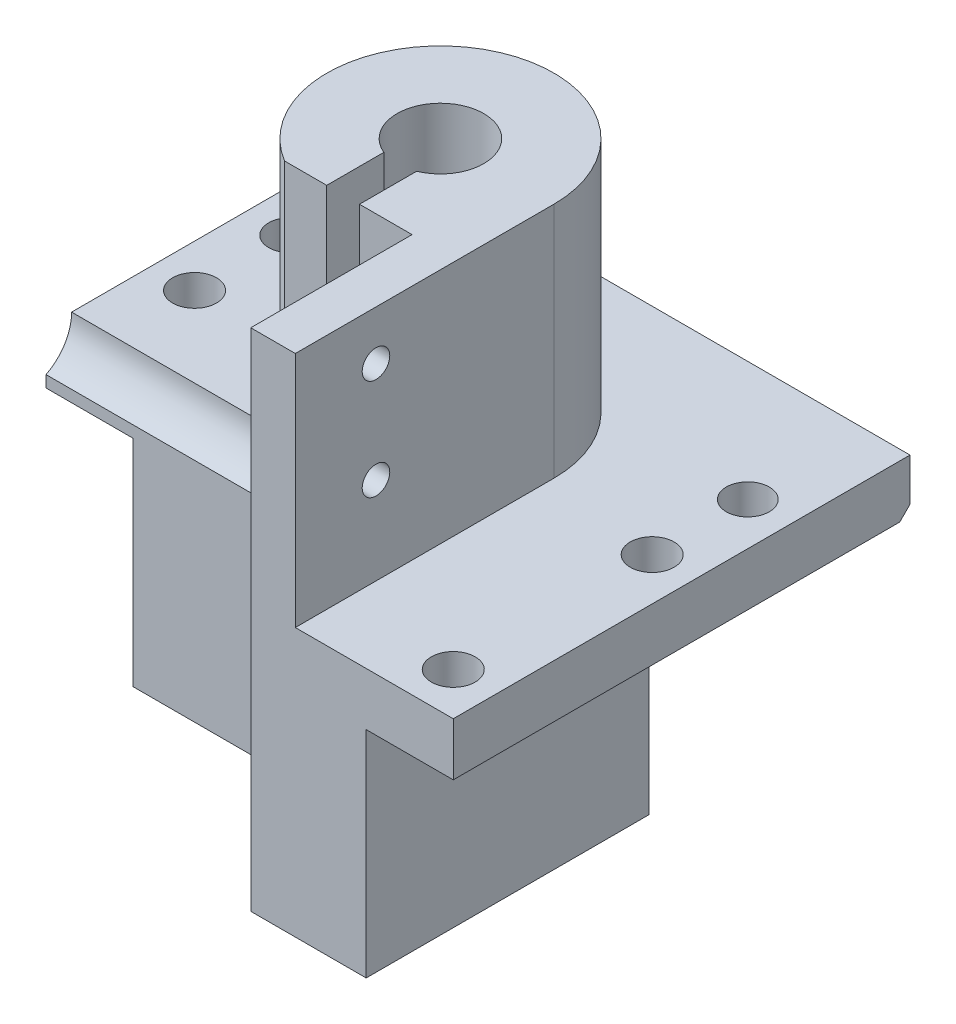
ISO-10303-21;
HEADER;
FILE_DESCRIPTION(('STEP AP214'),'2;1');
FILE_NAME('part.step','',(''),(''),'','','');
FILE_SCHEMA(('AUTOMOTIVE_DESIGN { 1 0 10303 214 1 1 1 1 }'));
ENDSEC;
DATA;
#1=APPLICATION_CONTEXT('core data for automotive mechanical design processes');
#2=APPLICATION_PROTOCOL_DEFINITION('international standard','automotive_design',2000,#1);
#3=PRODUCT_CONTEXT('',#1,'mechanical');
#4=PRODUCT('Part','Part','',(#3));
#5=PRODUCT_RELATED_PRODUCT_CATEGORY('part','',(#4));
#6=PRODUCT_DEFINITION_FORMATION('','',#4);
#7=PRODUCT_DEFINITION_CONTEXT('part definition',#1,'design');
#8=PRODUCT_DEFINITION('design','',#6,#7);
#9=PRODUCT_DEFINITION_SHAPE('','',#8);
#10=(LENGTH_UNIT() NAMED_UNIT(*) SI_UNIT(.MILLI.,.METRE.));
#11=(NAMED_UNIT(*) PLANE_ANGLE_UNIT() SI_UNIT($,.RADIAN.));
#12=(NAMED_UNIT(*) SI_UNIT($,.STERADIAN.) SOLID_ANGLE_UNIT());
#13=UNCERTAINTY_MEASURE_WITH_UNIT(LENGTH_MEASURE(1.E-05),#10,'distance_accuracy_value','');
#14=(GEOMETRIC_REPRESENTATION_CONTEXT(3) GLOBAL_UNCERTAINTY_ASSIGNED_CONTEXT((#13)) GLOBAL_UNIT_ASSIGNED_CONTEXT((#10,
#11,#12)) REPRESENTATION_CONTEXT('',''));
#15=CARTESIAN_POINT('',(0.,0.,0.));
#16=DIRECTION('',(0.,0.,1.));
#17=DIRECTION('',(1.,0.,0.));
#18=AXIS2_PLACEMENT_3D('',#15,#16,#17);
#19=CARTESIAN_POINT('',(0.,-16.002,0.));
#20=DIRECTION('',(0.,1.,0.));
#21=DIRECTION('',(0.,0.,1.));
#22=AXIS2_PLACEMENT_3D('',#19,#20,#21);
#23=CYLINDRICAL_SURFACE('',#22,15.7988);
#24=DIRECTION('',(0.,1.,0.));
#25=VECTOR('',#24,1.);
#26=CARTESIAN_POINT('',(-13.2513807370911,-16.002,8.60249905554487));
#27=LINE('',#26,#25);
#28=CARTESIAN_POINT('',(-13.2513807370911,0.,8.60249905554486));
#29=VERTEX_POINT('',#28);
#30=CARTESIAN_POINT('',(-13.2513807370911,-16.002,8.60249905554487));
#31=VERTEX_POINT('',#30);
#32=EDGE_CURVE('E58',#29,#31,#27,.F.);
#33=ORIENTED_EDGE('',*,*,#32,.F.);
#34=CARTESIAN_POINT('',(0.,0.,0.));
#35=DIRECTION('',(0.,1.,0.));
#36=DIRECTION('',(0.,0.,-1.));
#37=AXIS2_PLACEMENT_3D('',#34,#35,#36);
#38=CIRCLE('',#37,15.7988);
#39=CARTESIAN_POINT('',(13.2513807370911,0.,8.60249905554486));
#40=VERTEX_POINT('',#39);
#41=EDGE_CURVE('E222',#29,#40,#38,.T.);
#42=ORIENTED_EDGE('',*,*,#41,.T.);
#43=DIRECTION('',(0.,1.,0.));
#44=VECTOR('',#43,1.);
#45=CARTESIAN_POINT('',(13.2513807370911,-16.002,8.60249905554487));
#46=LINE('',#45,#44);
#47=CARTESIAN_POINT('',(13.2513807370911,-16.002,8.60249905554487));
#48=VERTEX_POINT('',#47);
#49=EDGE_CURVE('E193',#48,#40,#46,.T.);
#50=ORIENTED_EDGE('',*,*,#49,.F.);
#51=CARTESIAN_POINT('',(0.,-16.002,0.));
#52=DIRECTION('',(0.,1.,0.));
#53=DIRECTION('',(0.,0.,-1.));
#54=AXIS2_PLACEMENT_3D('',#51,#52,#53);
#55=CIRCLE('',#54,15.7988);
#56=EDGE_CURVE('E216',#31,#48,#55,.T.);
#57=ORIENTED_EDGE('',*,*,#56,.F.);
#58=EDGE_LOOP('',(#33,#42,#50,#57));
#59=FACE_BOUND('',#58,.T.);
#60=ADVANCED_FACE('F33',(#59),#23,.F.);
#61=CARTESIAN_POINT('',(13.716,-16.002,7.84049905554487));
#62=DIRECTION('',(-1.,0.,0.));
#63=DIRECTION('',(0.,0.,1.));
#64=AXIS2_PLACEMENT_3D('',#61,#62,#63);
#65=PLANE('',#64);
#66=DIRECTION('',(0.,-1.,0.));
#67=VECTOR('',#66,1.);
#68=CARTESIAN_POINT('',(13.716,-16.002,8.60249905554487));
#69=LINE('',#68,#67);
#70=CARTESIAN_POINT('',(13.716,0.,8.60249905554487));
#71=VERTEX_POINT('',#70);
#72=CARTESIAN_POINT('',(13.716,-16.002,8.60249905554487));
#73=VERTEX_POINT('',#72);
#74=EDGE_CURVE('E50',#71,#73,#69,.T.);
#75=ORIENTED_EDGE('',*,*,#74,.F.);
#76=DIRECTION('',(0.,0.,1.));
#77=VECTOR('',#76,1.);
#78=CARTESIAN_POINT('',(13.716,0.,7.84049905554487));
#79=LINE('',#78,#77);
#80=CARTESIAN_POINT('',(13.716,0.,29.653));
#81=VERTEX_POINT('',#80);
#82=EDGE_CURVE('E205',#71,#81,#79,.T.);
#83=ORIENTED_EDGE('',*,*,#82,.T.);
#84=DIRECTION('',(0.,-1.,0.));
#85=VECTOR('',#84,1.);
#86=CARTESIAN_POINT('',(13.716,-16.002,29.653));
#87=LINE('',#86,#85);
#88=CARTESIAN_POINT('',(13.716,-16.002,29.653));
#89=VERTEX_POINT('',#88);
#90=EDGE_CURVE('E484',#81,#89,#87,.T.);
#91=ORIENTED_EDGE('',*,*,#90,.T.);
#92=DIRECTION('',(0.,0.,1.));
#93=VECTOR('',#92,1.);
#94=CARTESIAN_POINT('',(13.716,-16.002,7.84049905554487));
#95=LINE('',#94,#93);
#96=EDGE_CURVE('E207',#73,#89,#95,.T.);
#97=ORIENTED_EDGE('',*,*,#96,.F.);
#98=EDGE_LOOP('',(#75,#83,#91,#97));
#99=FACE_BOUND('',#98,.T.);
#100=ADVANCED_FACE('F203',(#99),#65,.F.);
#101=CARTESIAN_POINT('',(-13.716,-16.002,25.4));
#102=DIRECTION('',(1.,0.,0.));
#103=DIRECTION('',(0.,0.,-1.));
#104=AXIS2_PLACEMENT_3D('',#101,#102,#103);
#105=PLANE('',#104);
#106=DIRECTION('',(0.,1.,0.));
#107=VECTOR('',#106,1.);
#108=CARTESIAN_POINT('',(-13.716,-16.002,8.60249905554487));
#109=LINE('',#108,#107);
#110=CARTESIAN_POINT('',(-13.716,-16.002,8.60249905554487));
#111=VERTEX_POINT('',#110);
#112=CARTESIAN_POINT('',(-13.716,0.,8.60249905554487));
#113=VERTEX_POINT('',#112);
#114=EDGE_CURVE('E198',#111,#113,#109,.T.);
#115=ORIENTED_EDGE('',*,*,#114,.F.);
#116=DIRECTION('',(0.,0.,-1.));
#117=VECTOR('',#116,1.);
#118=CARTESIAN_POINT('',(-13.716,-16.002,25.4));
#119=LINE('',#118,#117);
#120=CARTESIAN_POINT('',(-13.716,-16.002,19.558));
#121=VERTEX_POINT('',#120);
#122=EDGE_CURVE('E227',#121,#111,#119,.T.);
#123=ORIENTED_EDGE('',*,*,#122,.F.);
#124=DIRECTION('',(0.,1.,0.));
#125=VECTOR('',#124,1.);
#126=CARTESIAN_POINT('',(-13.716,-16.002,19.558));
#127=LINE('',#126,#125);
#128=CARTESIAN_POINT('',(-13.716,0.,19.558));
#129=VERTEX_POINT('',#128);
#130=EDGE_CURVE('E532',#121,#129,#127,.T.);
#131=ORIENTED_EDGE('',*,*,#130,.T.);
#132=DIRECTION('',(0.,0.,-1.));
#133=VECTOR('',#132,1.);
#134=CARTESIAN_POINT('',(-13.716,0.,25.4));
#135=LINE('',#134,#133);
#136=EDGE_CURVE('E212',#129,#113,#135,.T.);
#137=ORIENTED_EDGE('',*,*,#136,.T.);
#138=EDGE_LOOP('',(#115,#123,#131,#137));
#139=FACE_BOUND('',#138,.T.);
#140=ADVANCED_FACE('F373',(#139),#105,.F.);
#141=CARTESIAN_POINT('',(0.,-16.002,0.));
#142=DIRECTION('',(0.,-1.,0.));
#143=DIRECTION('',(0.,0.,-1.));
#144=AXIS2_PLACEMENT_3D('',#141,#142,#143);
#145=PLANE('',#144);
#146=CARTESIAN_POINT('',(9.271,-16.002,25.462));
#147=DIRECTION('',(0.,-1.,0.));
#148=DIRECTION('',(0.,0.,-1.));
#149=AXIS2_PLACEMENT_3D('',#146,#147,#148);
#150=CIRCLE('',#149,1.58369);
#151=CARTESIAN_POINT('',(9.271,-16.002,23.87831));
#152=VERTEX_POINT('',#151);
#153=EDGE_CURVE('E429',#152,#152,#150,.T.);
#154=ORIENTED_EDGE('',*,*,#153,.F.);
#155=EDGE_LOOP('',(#154));
#156=FACE_BOUND('',#155,.T.);
#157=CARTESIAN_POINT('',(-10.287,-16.002,16.637));
#158=DIRECTION('',(0.,-1.,0.));
#159=DIRECTION('',(0.,0.,-1.));
#160=AXIS2_PLACEMENT_3D('',#157,#158,#159);
#161=CIRCLE('',#160,1.1303);
#162=CARTESIAN_POINT('',(-10.287,-16.002,15.5067));
#163=VERTEX_POINT('',#162);
#164=EDGE_CURVE('E435',#163,#163,#161,.T.);
#165=ORIENTED_EDGE('',*,*,#164,.F.);
#166=EDGE_LOOP('',(#165));
#167=FACE_BOUND('',#166,.T.);
#168=CARTESIAN_POINT('',(9.271,-16.002,16.637));
#169=DIRECTION('',(0.,-1.,0.));
#170=DIRECTION('',(0.,0.,-1.));
#171=AXIS2_PLACEMENT_3D('',#168,#169,#170);
#172=CIRCLE('',#171,1.1303);
#173=CARTESIAN_POINT('',(9.271,-16.002,15.5067));
#174=VERTEX_POINT('',#173);
#175=EDGE_CURVE('E441',#174,#174,#172,.T.);
#176=ORIENTED_EDGE('',*,*,#175,.F.);
#177=EDGE_LOOP('',(#176));
#178=FACE_BOUND('',#177,.T.);
#179=ORIENTED_EDGE('',*,*,#122,.T.);
#180=DIRECTION('',(1.,0.,0.));
#181=VECTOR('',#180,1.);
#182=CARTESIAN_POINT('',(0.,-16.002,8.60249905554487));
#183=LINE('',#182,#181);
#184=EDGE_CURVE('E12',#111,#31,#183,.T.);
#185=ORIENTED_EDGE('',*,*,#184,.T.);
#186=ORIENTED_EDGE('',*,*,#56,.T.);
#187=EDGE_CURVE('E42',#48,#73,#183,.T.);
#188=ORIENTED_EDGE('',*,*,#187,.T.);
#189=ORIENTED_EDGE('',*,*,#96,.T.);
#190=DIRECTION('',(-1.,0.,0.));
#191=VECTOR('',#190,1.);
#192=CARTESIAN_POINT('',(5.13080000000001,-16.002,29.653));
#193=LINE('',#192,#191);
#194=CARTESIAN_POINT('',(5.1308,-16.002,29.653));
#195=VERTEX_POINT('',#194);
#196=EDGE_CURVE('E486',#89,#195,#193,.T.);
#197=ORIENTED_EDGE('',*,*,#196,.T.);
#198=DIRECTION('',(0.,0.,-1.));
#199=VECTOR('',#198,1.);
#200=CARTESIAN_POINT('',(5.1308,-16.002,25.4));
#201=LINE('',#200,#199);
#202=CARTESIAN_POINT('',(5.1308,-16.002,19.558));
#203=VERTEX_POINT('',#202);
#204=EDGE_CURVE('E518',#195,#203,#201,.T.);
#205=ORIENTED_EDGE('',*,*,#204,.T.);
#206=DIRECTION('',(1.,0.,0.));
#207=VECTOR('',#206,1.);
#208=CARTESIAN_POINT('',(-20.193,-16.002,19.558));
#209=LINE('',#208,#207);
#210=EDGE_CURVE('E529',#121,#203,#209,.T.);
#211=ORIENTED_EDGE('',*,*,#210,.F.);
#212=EDGE_LOOP('',(#179,#185,#186,#188,#189,#197,#205,#211));
#213=FACE_BOUND('',#212,.T.);
#214=ADVANCED_FACE('F581',(#156,#167,#178,#213),#145,.T.);
#215=CARTESIAN_POINT('',(8.4455,21.59,25.4));
#216=DIRECTION('',(-1.,0.,0.));
#217=DIRECTION('',(0.,-1.,0.));
#218=AXIS2_PLACEMENT_3D('',#215,#216,#217);
#219=PLANE('',#218);
#220=CARTESIAN_POINT('',(8.4455,17.937,23.653));
#221=DIRECTION('',(1.,0.,0.));
#222=DIRECTION('',(0.,0.,-1.));
#223=AXIS2_PLACEMENT_3D('',#220,#221,#222);
#224=CIRCLE('',#223,1.02499999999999);
#225=CARTESIAN_POINT('',(8.4455,17.937,22.628));
#226=VERTEX_POINT('',#225);
#227=EDGE_CURVE('E448',#226,#226,#224,.T.);
#228=ORIENTED_EDGE('',*,*,#227,.F.);
#229=EDGE_LOOP('',(#228));
#230=FACE_BOUND('',#229,.T.);
#231=CARTESIAN_POINT('',(8.4455,10.437,23.653));
#232=DIRECTION('',(1.,0.,0.));
#233=DIRECTION('',(0.,0.,-1.));
#234=AXIS2_PLACEMENT_3D('',#231,#232,#233);
#235=CIRCLE('',#234,1.025);
#236=CARTESIAN_POINT('',(8.4455,10.437,22.628));
#237=VERTEX_POINT('',#236);
#238=EDGE_CURVE('E452',#237,#237,#235,.T.);
#239=ORIENTED_EDGE('',*,*,#238,.F.);
#240=EDGE_LOOP('',(#239));
#241=FACE_BOUND('',#240,.T.);
#242=DIRECTION('',(0.,1.,0.));
#243=VECTOR('',#242,1.);
#244=CARTESIAN_POINT('',(8.4455,-27.2155864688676,10.414));
#245=LINE('',#244,#243);
#246=CARTESIAN_POINT('',(8.4455,3.937,10.414));
#247=VERTEX_POINT('',#246);
#248=CARTESIAN_POINT('',(8.4455,21.59,10.414));
#249=VERTEX_POINT('',#248);
#250=EDGE_CURVE('E460',#247,#249,#245,.T.);
#251=ORIENTED_EDGE('',*,*,#250,.T.);
#252=DIRECTION('',(0.,0.,-1.));
#253=VECTOR('',#252,1.);
#254=CARTESIAN_POINT('',(8.4455,21.59,25.4));
#255=LINE('',#254,#253);
#256=CARTESIAN_POINT('',(8.4455,21.59,29.653));
#257=VERTEX_POINT('',#256);
#258=EDGE_CURVE('E242',#257,#249,#255,.T.);
#259=ORIENTED_EDGE('',*,*,#258,.F.);
#260=DIRECTION('',(0.,-1.,0.));
#261=VECTOR('',#260,1.);
#262=CARTESIAN_POINT('',(8.4455,3.937,29.653));
#263=LINE('',#262,#261);
#264=CARTESIAN_POINT('',(8.4455,3.937,29.653));
#265=VERTEX_POINT('',#264);
#266=EDGE_CURVE('E474',#257,#265,#263,.T.);
#267=ORIENTED_EDGE('',*,*,#266,.T.);
#268=DIRECTION('',(0.,0.,1.));
#269=VECTOR('',#268,1.);
#270=CARTESIAN_POINT('',(8.4455,3.937,25.4));
#271=LINE('',#270,#269);
#272=EDGE_CURVE('E219',#247,#265,#271,.T.);
#273=ORIENTED_EDGE('',*,*,#272,.F.);
#274=EDGE_LOOP('',(#251,#259,#267,#273));
#275=FACE_BOUND('',#274,.T.);
#276=ADVANCED_FACE('F569',(#230,#241,#275),#219,.F.);
#277=CARTESIAN_POINT('',(8.4455,3.937,25.4));
#278=DIRECTION('',(0.,-1.,0.));
#279=DIRECTION('',(0.,0.,-1.));
#280=AXIS2_PLACEMENT_3D('',#277,#278,#279);
#281=PLANE('',#280);
#282=CARTESIAN_POINT('',(17.018,3.937,4.572));
#283=DIRECTION('',(0.,1.,0.));
#284=DIRECTION('',(0.,0.,1.));
#285=AXIS2_PLACEMENT_3D('',#282,#283,#284);
#286=CIRCLE('',#285,1.6002);
#287=CARTESIAN_POINT('',(17.018,3.937,6.1722));
#288=VERTEX_POINT('',#287);
#289=EDGE_CURVE('E619',#288,#288,#286,.T.);
#290=ORIENTED_EDGE('',*,*,#289,.F.);
#291=EDGE_LOOP('',(#290));
#292=FACE_BOUND('',#291,.T.);
#293=CARTESIAN_POINT('',(-17.018,3.937,4.572));
#294=DIRECTION('',(0.,1.,0.));
#295=DIRECTION('',(0.,0.,1.));
#296=AXIS2_PLACEMENT_3D('',#293,#294,#295);
#297=CIRCLE('',#296,1.6002);
#298=CARTESIAN_POINT('',(-17.018,3.937,6.1722));
#299=VERTEX_POINT('',#298);
#300=EDGE_CURVE('E613',#299,#299,#297,.T.);
#301=ORIENTED_EDGE('',*,*,#300,.F.);
#302=EDGE_LOOP('',(#301));
#303=FACE_BOUND('',#302,.T.);
#304=CARTESIAN_POINT('',(-17.018,3.937,11.684));
#305=DIRECTION('',(0.,-1.,0.));
#306=DIRECTION('',(0.,0.,-1.));
#307=AXIS2_PLACEMENT_3D('',#304,#305,#306);
#308=CIRCLE('',#307,1.63194999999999);
#309=CARTESIAN_POINT('',(-17.018,3.937,10.05205));
#310=VERTEX_POINT('',#309);
#311=EDGE_CURVE('E614',#310,#310,#308,.T.);
#312=ORIENTED_EDGE('',*,*,#311,.T.);
#313=EDGE_LOOP('',(#312));
#314=FACE_BOUND('',#313,.T.);
#315=CARTESIAN_POINT('',(17.018,3.937,11.684));
#316=DIRECTION('',(0.,-1.,0.));
#317=DIRECTION('',(0.,0.,-1.));
#318=AXIS2_PLACEMENT_3D('',#315,#316,#317);
#319=CIRCLE('',#318,1.63194999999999);
#320=CARTESIAN_POINT('',(17.018,3.937,10.05205));
#321=VERTEX_POINT('',#320);
#322=EDGE_CURVE('E418',#321,#321,#319,.T.);
#323=ORIENTED_EDGE('',*,*,#322,.T.);
#324=EDGE_LOOP('',(#323));
#325=FACE_BOUND('',#324,.T.);
#326=CARTESIAN_POINT('',(17.018,3.937,26.478));
#327=DIRECTION('',(0.,-1.,0.));
#328=DIRECTION('',(0.,0.,-1.));
#329=AXIS2_PLACEMENT_3D('',#326,#327,#328);
#330=CIRCLE('',#329,1.63194999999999);
#331=CARTESIAN_POINT('',(17.018,3.937,24.84605));
#332=VERTEX_POINT('',#331);
#333=EDGE_CURVE('E417',#332,#332,#330,.T.);
#334=ORIENTED_EDGE('',*,*,#333,.T.);
#335=EDGE_LOOP('',(#334));
#336=FACE_BOUND('',#335,.T.);
#337=DIRECTION('',(0.,0.,-1.));
#338=VECTOR('',#337,1.);
#339=CARTESIAN_POINT('',(-20.193,3.937,-4.318));
#340=LINE('',#339,#338);
#341=CARTESIAN_POINT('',(-20.193,3.937,17.653));
#342=VERTEX_POINT('',#341);
#343=CARTESIAN_POINT('',(-20.193,3.937,-4.318));
#344=VERTEX_POINT('',#343);
#345=EDGE_CURVE('E545',#342,#344,#340,.T.);
#346=ORIENTED_EDGE('',*,*,#345,.F.);
#347=DIRECTION('',(1.,0.,0.));
#348=VECTOR('',#347,1.);
#349=CARTESIAN_POINT('',(-20.193,3.937,17.653));
#350=LINE('',#349,#348);
#351=CARTESIAN_POINT('',(-4.35009761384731,3.937,17.653));
#352=VERTEX_POINT('',#351);
#353=EDGE_CURVE('E534',#342,#352,#350,.T.);
#354=ORIENTED_EDGE('',*,*,#353,.T.);
#355=CARTESIAN_POINT('',(0.,3.937,10.414));
#356=DIRECTION('',(0.,-1.,0.));
#357=DIRECTION('',(0.,0.,-1.));
#358=AXIS2_PLACEMENT_3D('',#355,#356,#357);
#359=CIRCLE('',#358,8.4455);
#360=EDGE_CURVE('E458',#352,#247,#359,.T.);
#361=ORIENTED_EDGE('',*,*,#360,.T.);
#362=ORIENTED_EDGE('',*,*,#272,.T.);
#363=DIRECTION('',(1.,0.,0.));
#364=VECTOR('',#363,1.);
#365=CARTESIAN_POINT('',(20.193,3.937,29.653));
#366=LINE('',#365,#364);
#367=CARTESIAN_POINT('',(20.193,3.937,29.653));
#368=VERTEX_POINT('',#367);
#369=EDGE_CURVE('E477',#265,#368,#366,.T.);
#370=ORIENTED_EDGE('',*,*,#369,.T.);
#371=DIRECTION('',(0.,0.,-1.));
#372=VECTOR('',#371,1.);
#373=CARTESIAN_POINT('',(20.193,3.937,-4.318));
#374=LINE('',#373,#372);
#375=CARTESIAN_POINT('',(20.193,3.937,-4.318));
#376=VERTEX_POINT('',#375);
#377=EDGE_CURVE('E552',#368,#376,#374,.T.);
#378=ORIENTED_EDGE('',*,*,#377,.T.);
#379=DIRECTION('',(-1.,0.,0.));
#380=VECTOR('',#379,1.);
#381=CARTESIAN_POINT('',(20.193,3.937,-4.318));
#382=LINE('',#381,#380);
#383=EDGE_CURVE('E554',#376,#344,#382,.T.);
#384=ORIENTED_EDGE('',*,*,#383,.T.);
#385=EDGE_LOOP('',(#346,#354,#361,#362,#370,#378,#384));
#386=FACE_BOUND('',#385,.T.);
#387=ADVANCED_FACE('F561',(#292,#303,#314,#325,#336,#386),#281,.F.);
#388=CARTESIAN_POINT('',(-20.193,3.937,-4.318));
#389=DIRECTION('',(-1.,0.,0.));
#390=DIRECTION('',(0.,0.,1.));
#391=AXIS2_PLACEMENT_3D('',#388,#389,#390);
#392=PLANE('',#391);
#393=DIRECTION('',(0.,-1.,0.));
#394=VECTOR('',#393,1.);
#395=CARTESIAN_POINT('',(-20.193,3.937,-4.318));
#396=LINE('',#395,#394);
#397=CARTESIAN_POINT('',(-20.193,0.762000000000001,-4.318));
#398=VERTEX_POINT('',#397);
#399=EDGE_CURVE('E547',#344,#398,#396,.T.);
#400=ORIENTED_EDGE('',*,*,#399,.T.);
#401=DIRECTION('',(0.,0.707106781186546,-0.707106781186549));
#402=VECTOR('',#401,1.);
#403=CARTESIAN_POINT('',(-20.193,2.34949999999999,-5.9055));
#404=LINE('',#403,#402);
#405=CARTESIAN_POINT('',(-20.193,0.,-3.556));
#406=VERTEX_POINT('',#405);
#407=EDGE_CURVE('E595',#398,#406,#404,.F.);
#408=ORIENTED_EDGE('',*,*,#407,.T.);
#409=DIRECTION('',(0.,0.,-1.));
#410=VECTOR('',#409,1.);
#411=CARTESIAN_POINT('',(-20.193,0.,-4.318));
#412=LINE('',#411,#410);
#413=CARTESIAN_POINT('',(-20.193,0.,19.558));
#414=VERTEX_POINT('',#413);
#415=EDGE_CURVE('E543',#414,#406,#412,.T.);
#416=ORIENTED_EDGE('',*,*,#415,.F.);
#417=DIRECTION('',(0.,-1.,0.));
#418=VECTOR('',#417,1.);
#419=CARTESIAN_POINT('',(-20.193,3.937,19.558));
#420=LINE('',#419,#418);
#421=CARTESIAN_POINT('',(-20.193,0.86527979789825,19.558));
#422=VERTEX_POINT('',#421);
#423=EDGE_CURVE('E245',#422,#414,#420,.T.);
#424=ORIENTED_EDGE('',*,*,#423,.F.);
#425=CARTESIAN_POINT('',(-20.193,3.937,21.082));
#426=DIRECTION('',(-1.,0.,0.));
#427=DIRECTION('',(0.,0.,1.));
#428=AXIS2_PLACEMENT_3D('',#425,#426,#427);
#429=CIRCLE('',#428,3.429);
#430=EDGE_CURVE('E468',#342,#422,#429,.T.);
#431=ORIENTED_EDGE('',*,*,#430,.F.);
#432=ORIENTED_EDGE('',*,*,#345,.T.);
#433=EDGE_LOOP('',(#400,#408,#416,#424,#431,#432));
#434=FACE_BOUND('',#433,.T.);
#435=ADVANCED_FACE('F593',(#434),#392,.T.);
#436=CARTESIAN_POINT('',(-20.193,3.937,19.558));
#437=DIRECTION('',(0.,0.,-1.));
#438=DIRECTION('',(0.,1.,0.));
#439=AXIS2_PLACEMENT_3D('',#436,#437,#438);
#440=PLANE('',#439);
#441=DIRECTION('',(1.,0.,0.));
#442=VECTOR('',#441,1.);
#443=CARTESIAN_POINT('',(-20.193,0.86527979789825,19.558));
#444=LINE('',#443,#442);
#445=CARTESIAN_POINT('',(5.1308,0.86527979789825,19.558));
#446=VERTEX_POINT('',#445);
#447=EDGE_CURVE('E470',#422,#446,#444,.T.);
#448=ORIENTED_EDGE('',*,*,#447,.F.);
#449=ORIENTED_EDGE('',*,*,#423,.T.);
#450=DIRECTION('',(-1.,0.,0.));
#451=VECTOR('',#450,1.);
#452=CARTESIAN_POINT('',(-8.4455,0.,19.558));
#453=LINE('',#452,#451);
#454=EDGE_CURVE('E540',#129,#414,#453,.T.);
#455=ORIENTED_EDGE('',*,*,#454,.F.);
#456=ORIENTED_EDGE('',*,*,#130,.F.);
#457=ORIENTED_EDGE('',*,*,#210,.T.);
#458=DIRECTION('',(0.,1.,0.));
#459=VECTOR('',#458,1.);
#460=CARTESIAN_POINT('',(5.1308,3.937,19.558));
#461=LINE('',#460,#459);
#462=EDGE_CURVE('E521',#203,#446,#461,.T.);
#463=ORIENTED_EDGE('',*,*,#462,.T.);
#464=EDGE_LOOP('',(#448,#449,#455,#456,#457,#463));
#465=FACE_BOUND('',#464,.T.);
#466=ADVANCED_FACE('F603',(#465),#440,.F.);
#467=CARTESIAN_POINT('',(-8.4455,21.59,25.4));
#468=DIRECTION('',(0.,-1.,0.));
#469=DIRECTION('',(0.,0.,-1.));
#470=AXIS2_PLACEMENT_3D('',#467,#468,#469);
#471=PLANE('',#470);
#472=ORIENTED_EDGE('',*,*,#258,.T.);
#473=CARTESIAN_POINT('',(0.,21.59,10.414));
#474=DIRECTION('',(0.,-1.,0.));
#475=DIRECTION('',(0.,0.,1.));
#476=AXIS2_PLACEMENT_3D('',#473,#474,#475);
#477=CIRCLE('',#476,8.4455);
#478=CARTESIAN_POINT('',(-4.35009761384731,21.59,17.653));
#479=VERTEX_POINT('',#478);
#480=EDGE_CURVE('E456',#479,#249,#477,.T.);
#481=ORIENTED_EDGE('',*,*,#480,.F.);
#482=DIRECTION('',(1.,0.,0.));
#483=VECTOR('',#482,1.);
#484=CARTESIAN_POINT('',(-20.193,21.59,17.653));
#485=LINE('',#484,#483);
#486=CARTESIAN_POINT('',(-1.2192,21.59,17.653));
#487=VERTEX_POINT('',#486);
#488=EDGE_CURVE('E530',#479,#487,#485,.T.);
#489=ORIENTED_EDGE('',*,*,#488,.T.);
#490=DIRECTION('',(0.,0.,1.));
#491=VECTOR('',#490,1.);
#492=CARTESIAN_POINT('',(-1.2192,21.59,8.70778260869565));
#493=LINE('',#492,#491);
#494=CARTESIAN_POINT('',(-1.2192,21.59,13.4005259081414));
#495=VERTEX_POINT('',#494);
#496=EDGE_CURVE('E500',#495,#487,#493,.T.);
#497=ORIENTED_EDGE('',*,*,#496,.F.);
#498=CARTESIAN_POINT('',(0.,21.59,10.414));
#499=DIRECTION('',(0.,1.,0.));
#500=DIRECTION('',(0.,0.,1.));
#501=AXIS2_PLACEMENT_3D('',#498,#499,#500);
#502=CIRCLE('',#501,3.2258);
#503=CARTESIAN_POINT('',(1.2192,21.59,13.4005259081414));
#504=VERTEX_POINT('',#503);
#505=EDGE_CURVE('E239',#504,#495,#502,.T.);
#506=ORIENTED_EDGE('',*,*,#505,.F.);
#507=DIRECTION('',(0.,0.,1.));
#508=VECTOR('',#507,1.);
#509=CARTESIAN_POINT('',(1.2192,21.59,8.70778260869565));
#510=LINE('',#509,#508);
#511=CARTESIAN_POINT('',(1.2192,21.59,17.653));
#512=VERTEX_POINT('',#511);
#513=EDGE_CURVE('E492',#504,#512,#510,.T.);
#514=ORIENTED_EDGE('',*,*,#513,.T.);
#515=CARTESIAN_POINT('',(5.1308,21.59,17.653));
#516=VERTEX_POINT('',#515);
#517=EDGE_CURVE('E533',#512,#516,#485,.T.);
#518=ORIENTED_EDGE('',*,*,#517,.T.);
#519=DIRECTION('',(0.,0.,1.));
#520=VECTOR('',#519,1.);
#521=CARTESIAN_POINT('',(5.1308,21.59,25.4));
#522=LINE('',#521,#520);
#523=CARTESIAN_POINT('',(5.1308,21.59,29.653));
#524=VERTEX_POINT('',#523);
#525=EDGE_CURVE('E527',#516,#524,#522,.T.);
#526=ORIENTED_EDGE('',*,*,#525,.T.);
#527=DIRECTION('',(1.,0.,0.));
#528=VECTOR('',#527,1.);
#529=CARTESIAN_POINT('',(8.44550000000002,21.59,29.653));
#530=LINE('',#529,#528);
#531=EDGE_CURVE('E473',#524,#257,#530,.T.);
#532=ORIENTED_EDGE('',*,*,#531,.T.);
#533=EDGE_LOOP('',(#472,#481,#489,#497,#506,#514,#518,#526,#532));
#534=FACE_BOUND('',#533,.T.);
#535=ADVANCED_FACE('F276',(#534),#471,.F.);
#536=CARTESIAN_POINT('',(0.,19.4315019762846,10.414));
#537=DIRECTION('',(0.,1.,0.));
#538=DIRECTION('',(0.,0.,1.));
#539=AXIS2_PLACEMENT_3D('',#536,#537,#538);
#540=CYLINDRICAL_SURFACE('',#539,3.2258);
#541=CARTESIAN_POINT('',(0.,0.428641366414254,10.414));
#542=DIRECTION('',(0.,1.,0.));
#543=DIRECTION('',(0.,0.,1.));
#544=AXIS2_PLACEMENT_3D('',#541,#542,#543);
#545=CIRCLE('',#544,3.2258);
#546=CARTESIAN_POINT('',(0.,0.428641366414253,13.6398));
#547=VERTEX_POINT('',#546);
#548=EDGE_CURVE('E236',#547,#547,#545,.T.);
#549=ORIENTED_EDGE('',*,*,#548,.F.);
#550=EDGE_LOOP('',(#549));
#551=FACE_BOUND('',#550,.T.);
#552=ORIENTED_EDGE('',*,*,#505,.T.);
#553=DIRECTION('',(0.,1.,0.));
#554=VECTOR('',#553,1.);
#555=CARTESIAN_POINT('',(-1.2192,19.4315019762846,13.4005259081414));
#556=LINE('',#555,#554);
#557=CARTESIAN_POINT('',(-1.2192,6.35,13.4005259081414));
#558=VERTEX_POINT('',#557);
#559=EDGE_CURVE('E512',#495,#558,#556,.F.);
#560=ORIENTED_EDGE('',*,*,#559,.T.);
#561=CARTESIAN_POINT('',(-1.2192,6.35,13.4005259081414));
#562=CARTESIAN_POINT('',(-1.21920115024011,6.31911373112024,13.4005224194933));
#563=CARTESIAN_POINT('',(-1.21794726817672,6.28824352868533,13.4010376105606));
#564=CARTESIAN_POINT('',(-1.21295397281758,6.2267481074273,13.4030699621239));
#565=CARTESIAN_POINT('',(-1.20921538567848,6.19612281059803,13.4045867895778));
#566=CARTESIAN_POINT('',(-1.19435270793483,6.10517555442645,13.4105692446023));
#567=CARTESIAN_POINT('',(-1.17958117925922,6.04550131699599,13.4164674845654));
#568=CARTESIAN_POINT('',(-1.14088253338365,5.9297258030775,13.4313822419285));
#569=CARTESIAN_POINT('',(-1.1169628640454,5.87362166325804,13.4403962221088));
#570=CARTESIAN_POINT('',(-1.06071669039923,5.7661714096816,13.4605646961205));
#571=CARTESIAN_POINT('',(-1.02838313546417,5.71482933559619,13.4717209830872));
#572=CARTESIAN_POINT('',(-0.954531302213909,5.61585683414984,13.4955945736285));
#573=CARTESIAN_POINT('',(-0.912664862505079,5.5684978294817,13.5083595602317));
#574=CARTESIAN_POINT('',(-0.821683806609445,5.48127963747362,13.5337515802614));
#575=CARTESIAN_POINT('',(-0.772567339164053,5.44142237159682,13.5463785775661));
#576=CARTESIAN_POINT('',(-0.666168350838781,5.3688309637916,13.5707538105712));
#577=CARTESIAN_POINT('',(-0.60864248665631,5.33643424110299,13.5824487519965));
#578=CARTESIAN_POINT('',(-0.488497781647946,5.28191693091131,13.6031786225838));
#579=CARTESIAN_POINT('',(-0.425884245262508,5.25978579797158,13.6122162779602));
#580=CARTESIAN_POINT('',(-0.315256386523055,5.23125109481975,13.6246974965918));
#581=CARTESIAN_POINT('',(-0.268009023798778,5.22218794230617,13.6289973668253));
#582=CARTESIAN_POINT('',(-0.172595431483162,5.21005232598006,13.6355397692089));
#583=CARTESIAN_POINT('',(-0.124428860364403,5.20698213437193,13.6377815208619));
#584=CARTESIAN_POINT('',(-0.0761999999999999,5.207,13.6388998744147));
#585=B_SPLINE_CURVE_WITH_KNOTS('',3,(#561,#562,#563,#564,#565,#566,#567,#568,#569,#570,#571,
#572,#573,#574,#575,#576,#577,#578,#579,#580,#581,#582,#583,#584),.UNSPECIFIED.,.F.,.F.,(4,2,2,
2,2,2,2,2,2,2,2,4),(0.,0.0925978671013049,0.185164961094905,0.369467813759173,0.55362093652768,
0.737928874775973,0.930540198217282,1.12320078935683,1.32335620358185,1.5233055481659,
1.66780262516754,1.81235447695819),.UNSPECIFIED.);
#586=CARTESIAN_POINT('',(-0.0762,5.207,13.6388998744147));
#587=VERTEX_POINT('',#586);
#588=EDGE_CURVE('E257',#558,#587,#585,.T.);
#589=ORIENTED_EDGE('',*,*,#588,.T.);
#590=CARTESIAN_POINT('',(0.,5.207,10.414));
#591=DIRECTION('',(0.,-1.,0.));
#592=DIRECTION('',(0.,0.,-1.));
#593=AXIS2_PLACEMENT_3D('',#590,#591,#592);
#594=CIRCLE('',#593,3.2258);
#595=CARTESIAN_POINT('',(0.0762,5.207,13.6388998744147));
#596=VERTEX_POINT('',#595);
#597=EDGE_CURVE('E515',#596,#587,#594,.T.);
#598=ORIENTED_EDGE('',*,*,#597,.F.);
#599=CARTESIAN_POINT('',(0.0762,5.207,13.6388998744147));
#600=CARTESIAN_POINT('',(0.107487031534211,5.20699915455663,13.6381630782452));
#601=CARTESIAN_POINT('',(0.138746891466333,5.20828542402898,13.6369658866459));
#602=CARTESIAN_POINT('',(0.201001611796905,5.21340455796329,13.6336821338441));
#603=CARTESIAN_POINT('',(0.231996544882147,5.21723669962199,13.6315958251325));
#604=CARTESIAN_POINT('',(0.324048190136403,5.2324707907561,13.6240694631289));
#605=CARTESIAN_POINT('',(0.384425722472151,5.24761091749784,13.6173555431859));
#606=CARTESIAN_POINT('',(0.501518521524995,5.2872773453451,13.6011252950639));
#607=CARTESIAN_POINT('',(0.558235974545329,5.31179798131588,13.5916106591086));
#608=CARTESIAN_POINT('',(0.666753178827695,5.36945277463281,13.5706252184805));
#609=CARTESIAN_POINT('',(0.718549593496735,5.4025927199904,13.5591531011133));
#610=CARTESIAN_POINT('',(0.817896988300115,5.47800722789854,13.5348247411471));
#611=CARTESIAN_POINT('',(0.865211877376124,5.52058102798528,13.5219324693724));
#612=CARTESIAN_POINT('',(0.952187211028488,5.61303011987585,13.4963989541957));
#613=CARTESIAN_POINT('',(0.991845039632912,5.66290789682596,13.4837577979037));
#614=CARTESIAN_POINT('',(1.0635921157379,5.77050234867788,13.4596589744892));
#615=CARTESIAN_POINT('',(1.0954024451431,5.82841699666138,13.448251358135));
#616=CARTESIAN_POINT('',(1.14867872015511,5.94926747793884,13.4284875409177));
#617=CARTESIAN_POINT('',(1.17015815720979,6.0121966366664,13.4201273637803));
#618=CARTESIAN_POINT('',(1.19700698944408,6.12120701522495,13.4095137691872));
#619=CARTESIAN_POINT('',(1.20530418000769,6.16648048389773,13.4061713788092));
#620=CARTESIAN_POINT('',(1.21641024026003,6.25782390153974,13.4016648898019));
#621=CARTESIAN_POINT('',(1.21921624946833,6.30389425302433,13.4005019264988));
#622=CARTESIAN_POINT('',(1.2192,6.35,13.4005259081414));
#623=B_SPLINE_CURVE_WITH_KNOTS('',3,(#599,#600,#601,#602,#603,#604,#605,#606,#607,#608,#609,
#610,#611,#612,#613,#614,#615,#616,#617,#618,#619,#620,#621,#622),.UNSPECIFIED.,.F.,.F.,(4,2,2,
2,2,2,2,2,2,2,2,4),(0.,0.0938257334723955,0.187624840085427,0.374471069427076,0.561204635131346,
0.748063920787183,0.942023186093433,1.13604859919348,1.33620810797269,1.53610550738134,
1.67418725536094,1.81234091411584),.UNSPECIFIED.);
#624=CARTESIAN_POINT('',(1.2192,6.35,13.4005259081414));
#625=VERTEX_POINT('',#624);
#626=EDGE_CURVE('E281',#596,#625,#623,.T.);
#627=ORIENTED_EDGE('',*,*,#626,.T.);
#628=DIRECTION('',(0.,1.,0.));
#629=VECTOR('',#628,1.);
#630=CARTESIAN_POINT('',(1.2192,19.4315019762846,13.4005259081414));
#631=LINE('',#630,#629);
#632=EDGE_CURVE('E509',#504,#625,#631,.F.);
#633=ORIENTED_EDGE('',*,*,#632,.F.);
#634=EDGE_LOOP('',(#552,#560,#589,#598,#627,#633));
#635=FACE_BOUND('',#634,.T.);
#636=ADVANCED_FACE('F270',(#551,#635),#540,.F.);
#637=CARTESIAN_POINT('',(-20.193,3.937,17.653));
#638=DIRECTION('',(0.,0.,-1.));
#639=DIRECTION('',(-1.,0.,0.));
#640=AXIS2_PLACEMENT_3D('',#637,#638,#639);
#641=PLANE('',#640);
#642=ORIENTED_EDGE('',*,*,#488,.F.);
#643=DIRECTION('',(0.,1.,0.));
#644=VECTOR('',#643,1.);
#645=CARTESIAN_POINT('',(-4.35009761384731,-27.2155864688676,17.653));
#646=LINE('',#645,#644);
#647=EDGE_CURVE('E463',#479,#352,#646,.F.);
#648=ORIENTED_EDGE('',*,*,#647,.T.);
#649=CARTESIAN_POINT('',(5.1308,3.937,17.653));
#650=VERTEX_POINT('',#649);
#651=EDGE_CURVE('E536',#352,#650,#350,.T.);
#652=ORIENTED_EDGE('',*,*,#651,.T.);
#653=DIRECTION('',(0.,1.,0.));
#654=VECTOR('',#653,1.);
#655=CARTESIAN_POINT('',(5.1308,3.937,17.653));
#656=LINE('',#655,#654);
#657=EDGE_CURVE('E524',#650,#516,#656,.T.);
#658=ORIENTED_EDGE('',*,*,#657,.T.);
#659=ORIENTED_EDGE('',*,*,#517,.F.);
#660=DIRECTION('',(0.,-1.,0.));
#661=VECTOR('',#660,1.);
#662=CARTESIAN_POINT('',(1.2192,5.207,17.653));
#663=LINE('',#662,#661);
#664=CARTESIAN_POINT('',(1.2192,6.35,17.653));
#665=VERTEX_POINT('',#664);
#666=EDGE_CURVE('E497',#512,#665,#663,.T.);
#667=ORIENTED_EDGE('',*,*,#666,.T.);
#668=CARTESIAN_POINT('',(0.0762,6.35,17.653));
#669=DIRECTION('',(0.,0.,-1.));
#670=DIRECTION('',(-1.,0.,0.));
#671=AXIS2_PLACEMENT_3D('',#668,#669,#670);
#672=CIRCLE('',#671,1.143);
#673=CARTESIAN_POINT('',(0.0762,5.207,17.653));
#674=VERTEX_POINT('',#673);
#675=EDGE_CURVE('E286',#665,#674,#672,.T.);
#676=ORIENTED_EDGE('',*,*,#675,.T.);
#677=DIRECTION('',(1.,0.,0.));
#678=VECTOR('',#677,1.);
#679=CARTESIAN_POINT('',(-1.2192,5.207,17.653));
#680=LINE('',#679,#678);
#681=CARTESIAN_POINT('',(-0.0762,5.207,17.653));
#682=VERTEX_POINT('',#681);
#683=EDGE_CURVE('E506',#682,#674,#680,.T.);
#684=ORIENTED_EDGE('',*,*,#683,.F.);
#685=CARTESIAN_POINT('',(-0.0762,6.35,17.653));
#686=DIRECTION('',(0.,0.,-1.));
#687=DIRECTION('',(-1.,0.,0.));
#688=AXIS2_PLACEMENT_3D('',#685,#686,#687);
#689=CIRCLE('',#688,1.143);
#690=CARTESIAN_POINT('',(-1.2192,6.35,17.653));
#691=VERTEX_POINT('',#690);
#692=EDGE_CURVE('E264',#682,#691,#689,.T.);
#693=ORIENTED_EDGE('',*,*,#692,.T.);
#694=DIRECTION('',(0.,-1.,0.));
#695=VECTOR('',#694,1.);
#696=CARTESIAN_POINT('',(-1.2192,5.207,17.653));
#697=LINE('',#696,#695);
#698=EDGE_CURVE('E503',#487,#691,#697,.T.);
#699=ORIENTED_EDGE('',*,*,#698,.F.);
#700=EDGE_LOOP('',(#642,#648,#652,#658,#659,#667,#676,#684,#693,#699));
#701=FACE_BOUND('',#700,.T.);
#702=ADVANCED_FACE('F275',(#701),#641,.F.);
#703=CARTESIAN_POINT('',(-8.4455,0.,25.4));
#704=DIRECTION('',(0.,1.,0.));
#705=DIRECTION('',(0.,0.,1.));
#706=AXIS2_PLACEMENT_3D('',#703,#704,#705);
#707=PLANE('',#706);
#708=CARTESIAN_POINT('',(17.018,0.,4.572));
#709=DIRECTION('',(0.,1.,0.));
#710=DIRECTION('',(0.,0.,1.));
#711=AXIS2_PLACEMENT_3D('',#708,#709,#710);
#712=CIRCLE('',#711,1.6002);
#713=CARTESIAN_POINT('',(17.018,0.,6.1722));
#714=VERTEX_POINT('',#713);
#715=EDGE_CURVE('E37',#714,#714,#712,.T.);
#716=ORIENTED_EDGE('',*,*,#715,.T.);
#717=EDGE_LOOP('',(#716));
#718=FACE_BOUND('',#717,.T.);
#719=CARTESIAN_POINT('',(-17.018,0.,4.572));
#720=DIRECTION('',(0.,1.,0.));
#721=DIRECTION('',(0.,0.,1.));
#722=AXIS2_PLACEMENT_3D('',#719,#720,#721);
#723=CIRCLE('',#722,1.6002);
#724=CARTESIAN_POINT('',(-17.018,0.,6.1722));
#725=VERTEX_POINT('',#724);
#726=EDGE_CURVE('E405',#725,#725,#723,.T.);
#727=ORIENTED_EDGE('',*,*,#726,.T.);
#728=EDGE_LOOP('',(#727));
#729=FACE_BOUND('',#728,.T.);
#730=CARTESIAN_POINT('',(-17.018,0.,11.684));
#731=DIRECTION('',(0.,-1.,0.));
#732=DIRECTION('',(0.,0.,-1.));
#733=AXIS2_PLACEMENT_3D('',#730,#731,#732);
#734=CIRCLE('',#733,1.63194999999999);
#735=CARTESIAN_POINT('',(-17.018,0.,10.05205));
#736=VERTEX_POINT('',#735);
#737=EDGE_CURVE('E409',#736,#736,#734,.T.);
#738=ORIENTED_EDGE('',*,*,#737,.F.);
#739=EDGE_LOOP('',(#738));
#740=FACE_BOUND('',#739,.T.);
#741=CARTESIAN_POINT('',(17.018,0.,11.684));
#742=DIRECTION('',(0.,-1.,0.));
#743=DIRECTION('',(0.,0.,-1.));
#744=AXIS2_PLACEMENT_3D('',#741,#742,#743);
#745=CIRCLE('',#744,1.63194999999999);
#746=CARTESIAN_POINT('',(17.018,0.,10.05205));
#747=VERTEX_POINT('',#746);
#748=EDGE_CURVE('E413',#747,#747,#745,.T.);
#749=ORIENTED_EDGE('',*,*,#748,.F.);
#750=EDGE_LOOP('',(#749));
#751=FACE_BOUND('',#750,.T.);
#752=CARTESIAN_POINT('',(17.018,0.,26.478));
#753=DIRECTION('',(0.,-1.,0.));
#754=DIRECTION('',(0.,0.,-1.));
#755=AXIS2_PLACEMENT_3D('',#752,#753,#754);
#756=CIRCLE('',#755,1.63194999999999);
#757=CARTESIAN_POINT('',(17.018,0.,24.84605));
#758=VERTEX_POINT('',#757);
#759=EDGE_CURVE('E416',#758,#758,#756,.T.);
#760=ORIENTED_EDGE('',*,*,#759,.F.);
#761=EDGE_LOOP('',(#760));
#762=FACE_BOUND('',#761,.T.);
#763=CARTESIAN_POINT('',(0.,0.,10.414));
#764=DIRECTION('',(0.,1.,0.));
#765=DIRECTION('',(0.,0.,1.));
#766=AXIS2_PLACEMENT_3D('',#763,#764,#765);
#767=CIRCLE('',#766,3.048);
#768=CARTESIAN_POINT('',(0.,0.,13.462));
#769=VERTEX_POINT('',#768);
#770=EDGE_CURVE('E230',#769,#769,#767,.T.);
#771=ORIENTED_EDGE('',*,*,#770,.T.);
#772=EDGE_LOOP('',(#771));
#773=FACE_BOUND('',#772,.T.);
#774=DIRECTION('',(-1.,0.,0.));
#775=VECTOR('',#774,1.);
#776=CARTESIAN_POINT('',(-24.0506628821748,0.,8.60249905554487));
#777=LINE('',#776,#775);
#778=EDGE_CURVE('E190',#71,#40,#777,.T.);
#779=ORIENTED_EDGE('',*,*,#778,.T.);
#780=ORIENTED_EDGE('',*,*,#41,.F.);
#781=EDGE_CURVE('E199',#29,#113,#777,.T.);
#782=ORIENTED_EDGE('',*,*,#781,.T.);
#783=ORIENTED_EDGE('',*,*,#136,.F.);
#784=ORIENTED_EDGE('',*,*,#454,.T.);
#785=ORIENTED_EDGE('',*,*,#415,.T.);
#786=DIRECTION('',(1.,0.,0.));
#787=VECTOR('',#786,1.);
#788=CARTESIAN_POINT('',(-8.4455,0.,-3.556));
#789=LINE('',#788,#787);
#790=CARTESIAN_POINT('',(20.193,0.,-3.556));
#791=VERTEX_POINT('',#790);
#792=EDGE_CURVE('E609',#406,#791,#789,.T.);
#793=ORIENTED_EDGE('',*,*,#792,.T.);
#794=DIRECTION('',(0.,0.,-1.));
#795=VECTOR('',#794,1.);
#796=CARTESIAN_POINT('',(20.193,0.,-4.318));
#797=LINE('',#796,#795);
#798=CARTESIAN_POINT('',(20.193,0.,29.653));
#799=VERTEX_POINT('',#798);
#800=EDGE_CURVE('E550',#799,#791,#797,.T.);
#801=ORIENTED_EDGE('',*,*,#800,.F.);
#802=DIRECTION('',(-1.,0.,0.));
#803=VECTOR('',#802,1.);
#804=CARTESIAN_POINT('',(13.716,0.,29.653));
#805=LINE('',#804,#803);
#806=EDGE_CURVE('E211',#799,#81,#805,.T.);
#807=ORIENTED_EDGE('',*,*,#806,.T.);
#808=ORIENTED_EDGE('',*,*,#82,.F.);
#809=EDGE_LOOP('',(#779,#780,#782,#783,#784,#785,#793,#801,#807,#808));
#810=FACE_BOUND('',#809,.T.);
#811=ADVANCED_FACE('F35',(#718,#729,#740,#751,#762,#773,#810),#707,.F.);
#812=CARTESIAN_POINT('',(0.,0.380999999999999,10.414));
#813=DIRECTION('',(0.,1.,0.));
#814=DIRECTION('',(0.,0.,1.));
#815=AXIS2_PLACEMENT_3D('',#812,#813,#814);
#816=CONICAL_SURFACE('',#815,3.048,1.30899693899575);
#817=ORIENTED_EDGE('',*,*,#548,.T.);
#818=EDGE_LOOP('',(#817));
#819=FACE_BOUND('',#818,.T.);
#820=CARTESIAN_POINT('',(0.,0.380999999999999,10.414));
#821=DIRECTION('',(0.,1.,0.));
#822=DIRECTION('',(0.,0.,1.));
#823=AXIS2_PLACEMENT_3D('',#820,#821,#822);
#824=CIRCLE('',#823,3.048);
#825=CARTESIAN_POINT('',(0.,0.380999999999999,13.462));
#826=VERTEX_POINT('',#825);
#827=EDGE_CURVE('E233',#826,#826,#824,.T.);
#828=ORIENTED_EDGE('',*,*,#827,.F.);
#829=EDGE_LOOP('',(#828));
#830=FACE_BOUND('',#829,.T.);
#831=ADVANCED_FACE('F278',(#819,#830),#816,.F.);
#832=CARTESIAN_POINT('',(0.,19.4315019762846,10.414));
#833=DIRECTION('',(0.,1.,0.));
#834=DIRECTION('',(0.,0.,1.));
#835=AXIS2_PLACEMENT_3D('',#832,#833,#834);
#836=CYLINDRICAL_SURFACE('',#835,3.048);
#837=ORIENTED_EDGE('',*,*,#827,.T.);
#838=EDGE_LOOP('',(#837));
#839=FACE_BOUND('',#838,.T.);
#840=ORIENTED_EDGE('',*,*,#770,.F.);
#841=EDGE_LOOP('',(#840));
#842=FACE_BOUND('',#841,.T.);
#843=ADVANCED_FACE('F376',(#839,#842),#836,.F.);
#844=CARTESIAN_POINT('',(20.193,3.937,-4.318));
#845=DIRECTION('',(-1.,0.,0.));
#846=DIRECTION('',(0.,0.,1.));
#847=AXIS2_PLACEMENT_3D('',#844,#845,#846);
#848=PLANE('',#847);
#849=ORIENTED_EDGE('',*,*,#800,.T.);
#850=DIRECTION('',(0.,-0.707106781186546,0.707106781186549));
#851=VECTOR('',#850,1.);
#852=CARTESIAN_POINT('',(20.193,0.762,-4.318));
#853=LINE('',#852,#851);
#854=CARTESIAN_POINT('',(20.193,0.762,-4.318));
#855=VERTEX_POINT('',#854);
#856=EDGE_CURVE('E608',#791,#855,#853,.F.);
#857=ORIENTED_EDGE('',*,*,#856,.T.);
#858=DIRECTION('',(0.,-1.,0.));
#859=VECTOR('',#858,1.);
#860=CARTESIAN_POINT('',(20.193,3.937,-4.318));
#861=LINE('',#860,#859);
#862=EDGE_CURVE('E213',#376,#855,#861,.T.);
#863=ORIENTED_EDGE('',*,*,#862,.F.);
#864=ORIENTED_EDGE('',*,*,#377,.F.);
#865=DIRECTION('',(0.,-1.,0.));
#866=VECTOR('',#865,1.);
#867=CARTESIAN_POINT('',(20.193,0.,29.653));
#868=LINE('',#867,#866);
#869=EDGE_CURVE('E480',#368,#799,#868,.T.);
#870=ORIENTED_EDGE('',*,*,#869,.T.);
#871=EDGE_LOOP('',(#849,#857,#863,#864,#870));
#872=FACE_BOUND('',#871,.T.);
#873=ADVANCED_FACE('F378',(#872),#848,.F.);
#874=CARTESIAN_POINT('',(20.193,3.937,-4.318));
#875=DIRECTION('',(0.,0.,1.));
#876=DIRECTION('',(1.,0.,0.));
#877=AXIS2_PLACEMENT_3D('',#874,#875,#876);
#878=PLANE('',#877);
#879=ORIENTED_EDGE('',*,*,#862,.T.);
#880=DIRECTION('',(-1.,0.,0.));
#881=VECTOR('',#880,1.);
#882=CARTESIAN_POINT('',(20.193,0.762,-4.318));
#883=LINE('',#882,#881);
#884=EDGE_CURVE('E590',#855,#398,#883,.T.);
#885=ORIENTED_EDGE('',*,*,#884,.T.);
#886=ORIENTED_EDGE('',*,*,#399,.F.);
#887=ORIENTED_EDGE('',*,*,#383,.F.);
#888=EDGE_LOOP('',(#879,#885,#886,#887));
#889=FACE_BOUND('',#888,.T.);
#890=ADVANCED_FACE('F384',(#889),#878,.F.);
#891=CARTESIAN_POINT('',(5.1308,21.59,25.4));
#892=DIRECTION('',(1.,0.,0.));
#893=DIRECTION('',(0.,0.,-1.));
#894=AXIS2_PLACEMENT_3D('',#891,#892,#893);
#895=PLANE('',#894);
#896=CARTESIAN_POINT('',(5.1308,17.937,23.653));
#897=DIRECTION('',(1.,0.,0.));
#898=DIRECTION('',(0.,0.,-1.));
#899=AXIS2_PLACEMENT_3D('',#896,#897,#898);
#900=CIRCLE('',#899,1.02499999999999);
#901=CARTESIAN_POINT('',(5.1308,17.937,22.628));
#902=VERTEX_POINT('',#901);
#903=EDGE_CURVE('E451',#902,#902,#900,.T.);
#904=ORIENTED_EDGE('',*,*,#903,.T.);
#905=EDGE_LOOP('',(#904));
#906=FACE_BOUND('',#905,.T.);
#907=CARTESIAN_POINT('',(5.1308,10.437,23.653));
#908=DIRECTION('',(1.,0.,0.));
#909=DIRECTION('',(0.,0.,-1.));
#910=AXIS2_PLACEMENT_3D('',#907,#908,#909);
#911=CIRCLE('',#910,1.02499999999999);
#912=CARTESIAN_POINT('',(5.1308,10.437,22.628));
#913=VERTEX_POINT('',#912);
#914=EDGE_CURVE('E455',#913,#913,#911,.T.);
#915=ORIENTED_EDGE('',*,*,#914,.T.);
#916=EDGE_LOOP('',(#915));
#917=FACE_BOUND('',#916,.T.);
#918=ORIENTED_EDGE('',*,*,#657,.F.);
#919=CARTESIAN_POINT('',(5.1308,3.937,21.082));
#920=DIRECTION('',(-1.,0.,0.));
#921=DIRECTION('',(0.,0.,1.));
#922=AXIS2_PLACEMENT_3D('',#919,#920,#921);
#923=CIRCLE('',#922,3.429);
#924=EDGE_CURVE('E466',#650,#446,#923,.T.);
#925=ORIENTED_EDGE('',*,*,#924,.T.);
#926=ORIENTED_EDGE('',*,*,#462,.F.);
#927=ORIENTED_EDGE('',*,*,#204,.F.);
#928=DIRECTION('',(0.,1.,0.));
#929=VECTOR('',#928,1.);
#930=CARTESIAN_POINT('',(5.1308,21.59,29.653));
#931=LINE('',#930,#929);
#932=EDGE_CURVE('E489',#195,#524,#931,.T.);
#933=ORIENTED_EDGE('',*,*,#932,.T.);
#934=ORIENTED_EDGE('',*,*,#525,.F.);
#935=EDGE_LOOP('',(#918,#925,#926,#927,#933,#934));
#936=FACE_BOUND('',#935,.T.);
#937=ADVANCED_FACE('F577',(#906,#917,#936),#895,.F.);
#938=CARTESIAN_POINT('',(-1.2192,5.207,8.70778260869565));
#939=DIRECTION('',(0.,-1.,0.));
#940=DIRECTION('',(0.,0.,-1.));
#941=AXIS2_PLACEMENT_3D('',#938,#939,#940);
#942=PLANE('',#941);
#943=ORIENTED_EDGE('',*,*,#597,.T.);
#944=DIRECTION('',(0.,0.,-1.));
#945=VECTOR('',#944,1.);
#946=CARTESIAN_POINT('',(-0.0762,5.207,8.70778260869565));
#947=LINE('',#946,#945);
#948=EDGE_CURVE('E253',#587,#682,#947,.F.);
#949=ORIENTED_EDGE('',*,*,#948,.T.);
#950=ORIENTED_EDGE('',*,*,#683,.T.);
#951=DIRECTION('',(0.,0.,-1.));
#952=VECTOR('',#951,1.);
#953=CARTESIAN_POINT('',(0.0762,5.207,13.4005259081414));
#954=LINE('',#953,#952);
#955=EDGE_CURVE('E250',#674,#596,#954,.T.);
#956=ORIENTED_EDGE('',*,*,#955,.T.);
#957=EDGE_LOOP('',(#943,#949,#950,#956));
#958=FACE_BOUND('',#957,.T.);
#959=ADVANCED_FACE('F677',(#958),#942,.F.);
#960=CARTESIAN_POINT('',(-1.2192,5.207,8.70778260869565));
#961=DIRECTION('',(1.,0.,0.));
#962=DIRECTION('',(0.,0.,-1.));
#963=AXIS2_PLACEMENT_3D('',#960,#961,#962);
#964=PLANE('',#963);
#965=ORIENTED_EDGE('',*,*,#698,.T.);
#966=DIRECTION('',(0.,0.,-1.));
#967=VECTOR('',#966,1.);
#968=CARTESIAN_POINT('',(-1.2192,6.35,8.70778260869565));
#969=LINE('',#968,#967);
#970=EDGE_CURVE('E247',#691,#558,#969,.T.);
#971=ORIENTED_EDGE('',*,*,#970,.T.);
#972=ORIENTED_EDGE('',*,*,#559,.F.);
#973=ORIENTED_EDGE('',*,*,#496,.T.);
#974=EDGE_LOOP('',(#965,#971,#972,#973));
#975=FACE_BOUND('',#974,.T.);
#976=ADVANCED_FACE('F914',(#975),#964,.T.);
#977=CARTESIAN_POINT('',(1.2192,5.207,8.70778260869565));
#978=DIRECTION('',(1.,0.,0.));
#979=DIRECTION('',(0.,0.,-1.));
#980=AXIS2_PLACEMENT_3D('',#977,#978,#979);
#981=PLANE('',#980);
#982=ORIENTED_EDGE('',*,*,#632,.T.);
#983=DIRECTION('',(0.,0.,-1.));
#984=VECTOR('',#983,1.);
#985=CARTESIAN_POINT('',(1.2192,6.35,17.653));
#986=LINE('',#985,#984);
#987=EDGE_CURVE('E255',#625,#665,#986,.F.);
#988=ORIENTED_EDGE('',*,*,#987,.T.);
#989=ORIENTED_EDGE('',*,*,#666,.F.);
#990=ORIENTED_EDGE('',*,*,#513,.F.);
#991=EDGE_LOOP('',(#982,#988,#989,#990));
#992=FACE_BOUND('',#991,.T.);
#993=ADVANCED_FACE('F907',(#992),#981,.F.);
#994=CARTESIAN_POINT('',(-0.0762,6.35,8.70778260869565));
#995=DIRECTION('',(0.,0.,-1.));
#996=DIRECTION('',(0.,1.,0.));
#997=AXIS2_PLACEMENT_3D('',#994,#995,#996);
#998=CYLINDRICAL_SURFACE('',#997,1.143);
#999=ORIENTED_EDGE('',*,*,#692,.F.);
#1000=ORIENTED_EDGE('',*,*,#948,.F.);
#1001=ORIENTED_EDGE('',*,*,#588,.F.);
#1002=ORIENTED_EDGE('',*,*,#970,.F.);
#1003=EDGE_LOOP('',(#999,#1000,#1001,#1002));
#1004=FACE_BOUND('',#1003,.T.);
#1005=ADVANCED_FACE('F266',(#1004),#998,.F.);
#1006=CARTESIAN_POINT('',(0.0762,6.35,8.70778260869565));
#1007=DIRECTION('',(0.,0.,1.));
#1008=DIRECTION('',(0.,-1.,0.));
#1009=AXIS2_PLACEMENT_3D('',#1006,#1007,#1008);
#1010=CYLINDRICAL_SURFACE('',#1009,1.143);
#1011=ORIENTED_EDGE('',*,*,#675,.F.);
#1012=ORIENTED_EDGE('',*,*,#987,.F.);
#1013=ORIENTED_EDGE('',*,*,#626,.F.);
#1014=ORIENTED_EDGE('',*,*,#955,.F.);
#1015=EDGE_LOOP('',(#1011,#1012,#1013,#1014));
#1016=FACE_BOUND('',#1015,.T.);
#1017=ADVANCED_FACE('F288',(#1016),#1010,.F.);
#1018=CARTESIAN_POINT('',(5.1308,3.93699999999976,29.653));
#1019=DIRECTION('',(0.,0.,-1.00000000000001));
#1020=DIRECTION('',(0.,1.00000000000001,0.));
#1021=AXIS2_PLACEMENT_3D('',#1018,#1019,#1020);
#1022=PLANE('',#1021);
#1023=ORIENTED_EDGE('',*,*,#196,.F.);
#1024=ORIENTED_EDGE('',*,*,#90,.F.);
#1025=ORIENTED_EDGE('',*,*,#806,.F.);
#1026=ORIENTED_EDGE('',*,*,#869,.F.);
#1027=ORIENTED_EDGE('',*,*,#369,.F.);
#1028=ORIENTED_EDGE('',*,*,#266,.F.);
#1029=ORIENTED_EDGE('',*,*,#531,.F.);
#1030=ORIENTED_EDGE('',*,*,#932,.F.);
#1031=EDGE_LOOP('',(#1023,#1024,#1025,#1026,#1027,#1028,#1029,#1030));
#1032=FACE_BOUND('',#1031,.T.);
#1033=ADVANCED_FACE('F292',(#1032),#1022,.F.);
#1034=CARTESIAN_POINT('',(-20.193,3.937,21.082));
#1035=DIRECTION('',(1.,0.,0.));
#1036=DIRECTION('',(0.,0.,-1.));
#1037=AXIS2_PLACEMENT_3D('',#1034,#1035,#1036);
#1038=CYLINDRICAL_SURFACE('',#1037,3.429);
#1039=ORIENTED_EDGE('',*,*,#353,.F.);
#1040=ORIENTED_EDGE('',*,*,#430,.T.);
#1041=ORIENTED_EDGE('',*,*,#447,.T.);
#1042=ORIENTED_EDGE('',*,*,#924,.F.);
#1043=ORIENTED_EDGE('',*,*,#651,.F.);
#1044=EDGE_LOOP('',(#1039,#1040,#1041,#1042,#1043));
#1045=FACE_BOUND('',#1044,.T.);
#1046=ADVANCED_FACE('F296',(#1045),#1038,.F.);
#1047=CARTESIAN_POINT('',(20.193,0.762,-4.318));
#1048=DIRECTION('',(0.,0.707106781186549,0.707106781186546));
#1049=DIRECTION('',(0.,-0.707106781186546,0.707106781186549));
#1050=AXIS2_PLACEMENT_3D('',#1047,#1048,#1049);
#1051=PLANE('',#1050);
#1052=ORIENTED_EDGE('',*,*,#856,.F.);
#1053=ORIENTED_EDGE('',*,*,#792,.F.);
#1054=ORIENTED_EDGE('',*,*,#407,.F.);
#1055=ORIENTED_EDGE('',*,*,#884,.F.);
#1056=EDGE_LOOP('',(#1052,#1053,#1054,#1055));
#1057=FACE_BOUND('',#1056,.T.);
#1058=ADVANCED_FACE('F300',(#1057),#1051,.F.);
#1059=CARTESIAN_POINT('',(0.,-27.2155864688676,10.414));
#1060=DIRECTION('',(0.,1.,0.));
#1061=DIRECTION('',(0.,0.,1.));
#1062=AXIS2_PLACEMENT_3D('',#1059,#1060,#1061);
#1063=CYLINDRICAL_SURFACE('',#1062,8.4455);
#1064=ORIENTED_EDGE('',*,*,#480,.T.);
#1065=ORIENTED_EDGE('',*,*,#250,.F.);
#1066=ORIENTED_EDGE('',*,*,#360,.F.);
#1067=ORIENTED_EDGE('',*,*,#647,.F.);
#1068=EDGE_LOOP('',(#1064,#1065,#1066,#1067));
#1069=FACE_BOUND('',#1068,.T.);
#1070=ADVANCED_FACE('F304',(#1069),#1063,.T.);
#1071=CARTESIAN_POINT('',(8.4455,10.437,23.653));
#1072=DIRECTION('',(1.,0.,0.));
#1073=DIRECTION('',(0.,0.,-1.));
#1074=AXIS2_PLACEMENT_3D('',#1071,#1072,#1073);
#1075=CYLINDRICAL_SURFACE('',#1074,1.02499999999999);
#1076=ORIENTED_EDGE('',*,*,#238,.T.);
#1077=EDGE_LOOP('',(#1076));
#1078=FACE_BOUND('',#1077,.T.);
#1079=ORIENTED_EDGE('',*,*,#914,.F.);
#1080=EDGE_LOOP('',(#1079));
#1081=FACE_BOUND('',#1080,.T.);
#1082=ADVANCED_FACE('F308',(#1078,#1081),#1075,.F.);
#1083=CARTESIAN_POINT('',(8.4455,17.937,23.653));
#1084=DIRECTION('',(1.,0.,0.));
#1085=DIRECTION('',(0.,0.,-1.));
#1086=AXIS2_PLACEMENT_3D('',#1083,#1084,#1085);
#1087=CYLINDRICAL_SURFACE('',#1086,1.02499999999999);
#1088=ORIENTED_EDGE('',*,*,#227,.T.);
#1089=EDGE_LOOP('',(#1088));
#1090=FACE_BOUND('',#1089,.T.);
#1091=ORIENTED_EDGE('',*,*,#903,.F.);
#1092=EDGE_LOOP('',(#1091));
#1093=FACE_BOUND('',#1092,.T.);
#1094=ADVANCED_FACE('F312',(#1090,#1093),#1087,.F.);
#1095=CARTESIAN_POINT('',(-24.0506628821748,-16.002,8.60249905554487));
#1096=DIRECTION('',(0.,0.,-1.));
#1097=DIRECTION('',(-1.,0.,0.));
#1098=AXIS2_PLACEMENT_3D('',#1095,#1096,#1097);
#1099=PLANE('',#1098);
#1100=ORIENTED_EDGE('',*,*,#49,.T.);
#1101=ORIENTED_EDGE('',*,*,#778,.F.);
#1102=ORIENTED_EDGE('',*,*,#74,.T.);
#1103=ORIENTED_EDGE('',*,*,#187,.F.);
#1104=EDGE_LOOP('',(#1100,#1101,#1102,#1103));
#1105=FACE_BOUND('',#1104,.T.);
#1106=ADVANCED_FACE('F191',(#1105),#1099,.T.);
#1107=ORIENTED_EDGE('',*,*,#32,.T.);
#1108=ORIENTED_EDGE('',*,*,#184,.F.);
#1109=ORIENTED_EDGE('',*,*,#114,.T.);
#1110=ORIENTED_EDGE('',*,*,#781,.F.);
#1111=EDGE_LOOP('',(#1107,#1108,#1109,#1110));
#1112=FACE_BOUND('',#1111,.T.);
#1113=ADVANCED_FACE('F317',(#1112),#1099,.T.);
#1114=CARTESIAN_POINT('',(9.271,-16.002,16.637));
#1115=DIRECTION('',(0.,-1.,0.));
#1116=DIRECTION('',(0.,0.,-1.));
#1117=AXIS2_PLACEMENT_3D('',#1114,#1115,#1116);
#1118=CYLINDRICAL_SURFACE('',#1117,1.1303);
#1119=CARTESIAN_POINT('',(9.271,-3.937,16.637));
#1120=DIRECTION('',(0.,-1.,0.));
#1121=DIRECTION('',(0.,0.,-1.));
#1122=AXIS2_PLACEMENT_3D('',#1119,#1120,#1121);
#1123=CIRCLE('',#1122,1.1303);
#1124=CARTESIAN_POINT('',(9.271,-3.937,15.5067));
#1125=VERTEX_POINT('',#1124);
#1126=EDGE_CURVE('E438',#1125,#1125,#1123,.T.);
#1127=ORIENTED_EDGE('',*,*,#1126,.F.);
#1128=EDGE_LOOP('',(#1127));
#1129=FACE_BOUND('',#1128,.T.);
#1130=ORIENTED_EDGE('',*,*,#175,.T.);
#1131=EDGE_LOOP('',(#1130));
#1132=FACE_BOUND('',#1131,.T.);
#1133=ADVANCED_FACE('F320',(#1129,#1132),#1118,.F.);
#1134=CARTESIAN_POINT('',(9.271,-3.937,16.637));
#1135=DIRECTION('',(0.,1.,0.));
#1136=DIRECTION('',(0.,0.,1.));
#1137=AXIS2_PLACEMENT_3D('',#1134,#1135,#1136);
#1138=PLANE('',#1137);
#1139=ORIENTED_EDGE('',*,*,#1126,.T.);
#1140=EDGE_LOOP('',(#1139));
#1141=FACE_BOUND('',#1140,.T.);
#1142=ADVANCED_FACE('F323',(#1141),#1138,.F.);
#1143=CARTESIAN_POINT('',(-10.287,-16.002,16.637));
#1144=DIRECTION('',(0.,-1.,0.));
#1145=DIRECTION('',(0.,0.,-1.));
#1146=AXIS2_PLACEMENT_3D('',#1143,#1144,#1145);
#1147=CYLINDRICAL_SURFACE('',#1146,1.1303);
#1148=CARTESIAN_POINT('',(-10.287,-3.937,16.637));
#1149=DIRECTION('',(0.,-1.,0.));
#1150=DIRECTION('',(0.,0.,-1.));
#1151=AXIS2_PLACEMENT_3D('',#1148,#1149,#1150);
#1152=CIRCLE('',#1151,1.1303);
#1153=CARTESIAN_POINT('',(-10.287,-3.937,15.5067));
#1154=VERTEX_POINT('',#1153);
#1155=EDGE_CURVE('E432',#1154,#1154,#1152,.T.);
#1156=ORIENTED_EDGE('',*,*,#1155,.F.);
#1157=EDGE_LOOP('',(#1156));
#1158=FACE_BOUND('',#1157,.T.);
#1159=ORIENTED_EDGE('',*,*,#164,.T.);
#1160=EDGE_LOOP('',(#1159));
#1161=FACE_BOUND('',#1160,.T.);
#1162=ADVANCED_FACE('F327',(#1158,#1161),#1147,.F.);
#1163=CARTESIAN_POINT('',(-10.287,-3.937,16.637));
#1164=DIRECTION('',(0.,1.,0.));
#1165=DIRECTION('',(0.,0.,1.));
#1166=AXIS2_PLACEMENT_3D('',#1163,#1164,#1165);
#1167=PLANE('',#1166);
#1168=ORIENTED_EDGE('',*,*,#1155,.T.);
#1169=EDGE_LOOP('',(#1168));
#1170=FACE_BOUND('',#1169,.T.);
#1171=ADVANCED_FACE('F331',(#1170),#1167,.F.);
#1172=CARTESIAN_POINT('',(9.271,-16.002,25.462));
#1173=DIRECTION('',(0.,-1.,0.));
#1174=DIRECTION('',(0.,0.,-1.));
#1175=AXIS2_PLACEMENT_3D('',#1172,#1173,#1174);
#1176=CYLINDRICAL_SURFACE('',#1175,1.58369);
#1177=CARTESIAN_POINT('',(9.271,-9.652,25.462));
#1178=DIRECTION('',(0.,-1.,0.));
#1179=DIRECTION('',(0.,0.,-1.));
#1180=AXIS2_PLACEMENT_3D('',#1177,#1178,#1179);
#1181=CIRCLE('',#1180,1.58369);
#1182=CARTESIAN_POINT('',(9.271,-9.652,23.87831));
#1183=VERTEX_POINT('',#1182);
#1184=EDGE_CURVE('E421',#1183,#1183,#1181,.T.);
#1185=ORIENTED_EDGE('',*,*,#1184,.F.);
#1186=EDGE_LOOP('',(#1185));
#1187=FACE_BOUND('',#1186,.T.);
#1188=ORIENTED_EDGE('',*,*,#153,.T.);
#1189=EDGE_LOOP('',(#1188));
#1190=FACE_BOUND('',#1189,.T.);
#1191=ADVANCED_FACE('F335',(#1187,#1190),#1176,.F.);
#1192=CARTESIAN_POINT('',(9.271,-9.652,25.462));
#1193=DIRECTION('',(0.,1.,0.));
#1194=DIRECTION('',(0.,0.,1.));
#1195=AXIS2_PLACEMENT_3D('',#1192,#1193,#1194);
#1196=PLANE('',#1195);
#1197=ORIENTED_EDGE('',*,*,#1184,.T.);
#1198=EDGE_LOOP('',(#1197));
#1199=FACE_BOUND('',#1198,.T.);
#1200=ADVANCED_FACE('F339',(#1199),#1196,.F.);
#1201=CARTESIAN_POINT('',(17.018,0.,26.478));
#1202=DIRECTION('',(0.,-1.,0.));
#1203=DIRECTION('',(0.,0.,-1.));
#1204=AXIS2_PLACEMENT_3D('',#1201,#1202,#1203);
#1205=CYLINDRICAL_SURFACE('',#1204,1.63194999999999);
#1206=ORIENTED_EDGE('',*,*,#759,.T.);
#1207=EDGE_LOOP('',(#1206));
#1208=FACE_BOUND('',#1207,.T.);
#1209=ORIENTED_EDGE('',*,*,#333,.F.);
#1210=EDGE_LOOP('',(#1209));
#1211=FACE_BOUND('',#1210,.T.);
#1212=ADVANCED_FACE('F343',(#1208,#1211),#1205,.F.);
#1213=CARTESIAN_POINT('',(17.018,0.,11.684));
#1214=DIRECTION('',(0.,-1.,0.));
#1215=DIRECTION('',(0.,0.,-1.));
#1216=AXIS2_PLACEMENT_3D('',#1213,#1214,#1215);
#1217=CYLINDRICAL_SURFACE('',#1216,1.63194999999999);
#1218=ORIENTED_EDGE('',*,*,#748,.T.);
#1219=EDGE_LOOP('',(#1218));
#1220=FACE_BOUND('',#1219,.T.);
#1221=ORIENTED_EDGE('',*,*,#322,.F.);
#1222=EDGE_LOOP('',(#1221));
#1223=FACE_BOUND('',#1222,.T.);
#1224=ADVANCED_FACE('F347',(#1220,#1223),#1217,.F.);
#1225=CARTESIAN_POINT('',(-17.018,0.,11.684));
#1226=DIRECTION('',(0.,-1.,0.));
#1227=DIRECTION('',(0.,0.,-1.));
#1228=AXIS2_PLACEMENT_3D('',#1225,#1226,#1227);
#1229=CYLINDRICAL_SURFACE('',#1228,1.63194999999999);
#1230=ORIENTED_EDGE('',*,*,#737,.T.);
#1231=EDGE_LOOP('',(#1230));
#1232=FACE_BOUND('',#1231,.T.);
#1233=ORIENTED_EDGE('',*,*,#311,.F.);
#1234=EDGE_LOOP('',(#1233));
#1235=FACE_BOUND('',#1234,.T.);
#1236=ADVANCED_FACE('F351',(#1232,#1235),#1229,.F.);
#1237=CARTESIAN_POINT('',(-17.018,3.937,4.572));
#1238=DIRECTION('',(0.,1.,0.));
#1239=DIRECTION('',(0.,0.,1.));
#1240=AXIS2_PLACEMENT_3D('',#1237,#1238,#1239);
#1241=CYLINDRICAL_SURFACE('',#1240,1.6002);
#1242=ORIENTED_EDGE('',*,*,#300,.T.);
#1243=EDGE_LOOP('',(#1242));
#1244=FACE_BOUND('',#1243,.T.);
#1245=ORIENTED_EDGE('',*,*,#726,.F.);
#1246=EDGE_LOOP('',(#1245));
#1247=FACE_BOUND('',#1246,.T.);
#1248=ADVANCED_FACE('F355',(#1244,#1247),#1241,.F.);
#1249=CARTESIAN_POINT('',(17.018,3.937,4.572));
#1250=DIRECTION('',(0.,1.,0.));
#1251=DIRECTION('',(0.,0.,1.));
#1252=AXIS2_PLACEMENT_3D('',#1249,#1250,#1251);
#1253=CYLINDRICAL_SURFACE('',#1252,1.6002);
#1254=ORIENTED_EDGE('',*,*,#289,.T.);
#1255=EDGE_LOOP('',(#1254));
#1256=FACE_BOUND('',#1255,.T.);
#1257=ORIENTED_EDGE('',*,*,#715,.F.);
#1258=EDGE_LOOP('',(#1257));
#1259=FACE_BOUND('',#1258,.T.);
#1260=ADVANCED_FACE('F359',(#1256,#1259),#1253,.F.);
#1261=CLOSED_SHELL('',(#60,#100,#140,#214,#276,#387,#435,#466,#535,#636,#702,#811,#831,#843,
#873,#890,#937,#959,#976,#993,#1005,#1017,#1033,#1046,#1058,#1070,#1082,#1094,#1106,#1113,#1133,
#1142,#1162,#1171,#1191,#1200,#1212,#1224,#1236,#1248,#1260));
#1262=MANIFOLD_SOLID_BREP('B2',#1261);
#1263=ADVANCED_BREP_SHAPE_REPRESENTATION('',(#18,#1262),#14);
#1264=SHAPE_DEFINITION_REPRESENTATION(#9,#1263);
ENDSEC;
END-ISO-10303-21;
